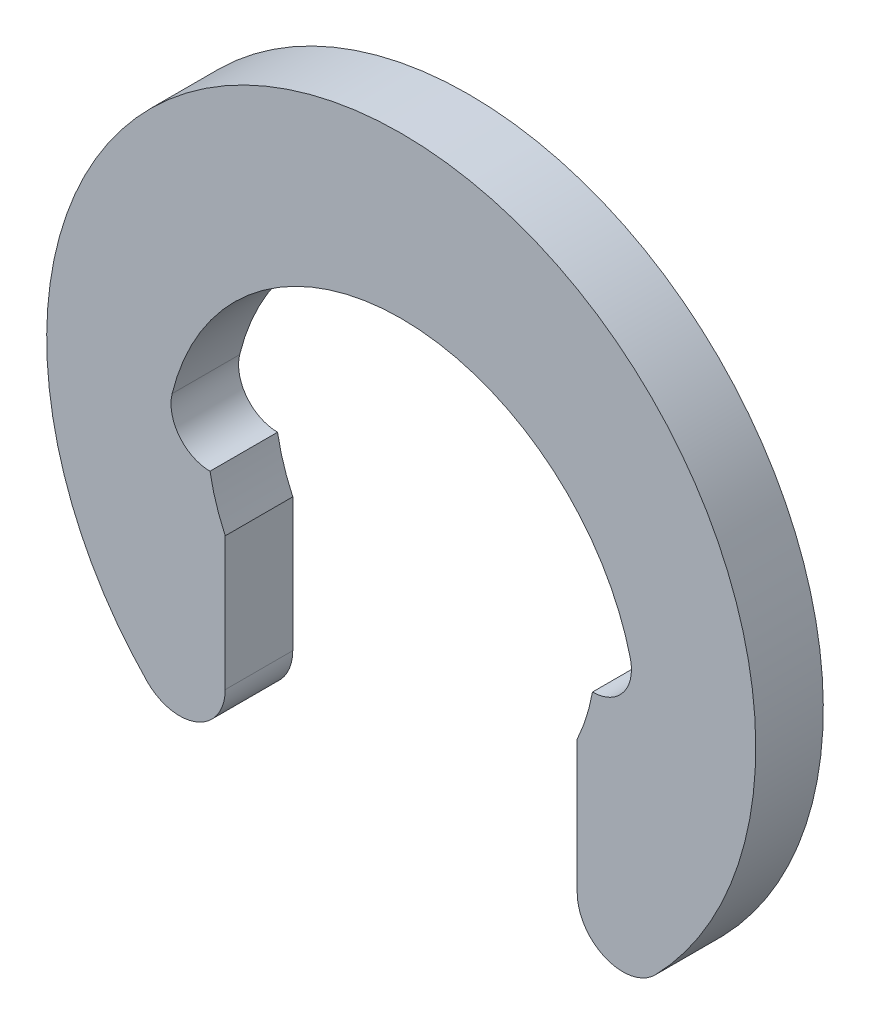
ISO-10303-21;
HEADER;
FILE_DESCRIPTION(('STEP AP214'),'2;1');
FILE_NAME('part.step','',(''),(''),'','','');
FILE_SCHEMA(('AUTOMOTIVE_DESIGN { 1 0 10303 214 1 1 1 1 }'));
ENDSEC;
DATA;
#1=APPLICATION_CONTEXT('core data for automotive mechanical design processes');
#2=APPLICATION_PROTOCOL_DEFINITION('international standard','automotive_design',2000,#1);
#3=PRODUCT_CONTEXT('',#1,'mechanical');
#4=PRODUCT('Part','Part','',(#3));
#5=PRODUCT_RELATED_PRODUCT_CATEGORY('part','',(#4));
#6=PRODUCT_DEFINITION_FORMATION('','',#4);
#7=PRODUCT_DEFINITION_CONTEXT('part definition',#1,'design');
#8=PRODUCT_DEFINITION('design','',#6,#7);
#9=PRODUCT_DEFINITION_SHAPE('','',#8);
#10=(LENGTH_UNIT() NAMED_UNIT(*) SI_UNIT(.MILLI.,.METRE.));
#11=(NAMED_UNIT(*) PLANE_ANGLE_UNIT() SI_UNIT($,.RADIAN.));
#12=(NAMED_UNIT(*) SI_UNIT($,.STERADIAN.) SOLID_ANGLE_UNIT());
#13=UNCERTAINTY_MEASURE_WITH_UNIT(LENGTH_MEASURE(1.E-05),#10,'distance_accuracy_value','');
#14=(GEOMETRIC_REPRESENTATION_CONTEXT(3) GLOBAL_UNCERTAINTY_ASSIGNED_CONTEXT((#13)) GLOBAL_UNIT_ASSIGNED_CONTEXT((#10,
#11,#12)) REPRESENTATION_CONTEXT('',''));
#15=CARTESIAN_POINT('',(0.,0.,0.));
#16=DIRECTION('',(0.,0.,1.));
#17=DIRECTION('',(1.,0.,0.));
#18=AXIS2_PLACEMENT_3D('',#15,#16,#17);
#19=CARTESIAN_POINT('',(0.,0.,-0.4));
#20=DIRECTION('',(0.,0.,1.));
#21=DIRECTION('',(1.,0.,0.));
#22=AXIS2_PLACEMENT_3D('',#19,#20,#21);
#23=CYLINDRICAL_SURFACE('',#22,1.15);
#24=CARTESIAN_POINT('',(0.,0.,0.));
#25=DIRECTION('',(0.,0.,-1.));
#26=DIRECTION('',(1.,0.,0.));
#27=AXIS2_PLACEMENT_3D('',#24,#25,#26);
#28=CIRCLE('',#27,1.15);
#29=CARTESIAN_POINT('',(-1.04225395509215,-0.486011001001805,0.));
#30=VERTEX_POINT('',#29);
#31=CARTESIAN_POINT('',(-1.13252891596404,-0.19969540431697,0.));
#32=VERTEX_POINT('',#31);
#33=EDGE_CURVE('E141',#30,#32,#28,.T.);
#34=ORIENTED_EDGE('',*,*,#33,.F.);
#35=DIRECTION('',(0.,0.,1.));
#36=VECTOR('',#35,1.);
#37=CARTESIAN_POINT('',(-1.04225395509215,-0.486011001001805,-0.4));
#38=LINE('',#37,#36);
#39=CARTESIAN_POINT('',(-1.04225395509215,-0.486011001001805,-0.4));
#40=VERTEX_POINT('',#39);
#41=EDGE_CURVE('E11',#40,#30,#38,.T.);
#42=ORIENTED_EDGE('',*,*,#41,.F.);
#43=CARTESIAN_POINT('',(0.,0.,-0.4));
#44=DIRECTION('',(0.,0.,-1.));
#45=DIRECTION('',(1.,0.,0.));
#46=AXIS2_PLACEMENT_3D('',#43,#44,#45);
#47=CIRCLE('',#46,1.15);
#48=CARTESIAN_POINT('',(-1.13252891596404,-0.19969540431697,-0.4));
#49=VERTEX_POINT('',#48);
#50=EDGE_CURVE('E167',#40,#49,#47,.T.);
#51=ORIENTED_EDGE('',*,*,#50,.T.);
#52=DIRECTION('',(0.,0.,1.));
#53=VECTOR('',#52,1.);
#54=CARTESIAN_POINT('',(-1.13252891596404,-0.19969540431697,-0.4));
#55=LINE('',#54,#53);
#56=EDGE_CURVE('E35',#49,#32,#55,.T.);
#57=ORIENTED_EDGE('',*,*,#56,.T.);
#58=EDGE_LOOP('',(#34,#42,#51,#57));
#59=FACE_BOUND('',#58,.T.);
#60=ADVANCED_FACE('F32',(#59),#23,.F.);
#61=CARTESIAN_POINT('',(-1.04225395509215,-0.486011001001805,-0.4));
#62=DIRECTION('',(1.,0.,0.));
#63=DIRECTION('',(0.,1.,0.));
#64=AXIS2_PLACEMENT_3D('',#61,#62,#63);
#65=PLANE('',#64);
#66=DIRECTION('',(0.,1.,0.));
#67=VECTOR('',#66,1.);
#68=CARTESIAN_POINT('',(-1.04225395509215,-0.486011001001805,0.));
#69=LINE('',#68,#67);
#70=CARTESIAN_POINT('',(-1.04225395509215,-1.27483758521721,0.));
#71=VERTEX_POINT('',#70);
#72=EDGE_CURVE('E165',#71,#30,#69,.T.);
#73=ORIENTED_EDGE('',*,*,#72,.F.);
#74=DIRECTION('',(0.,0.,1.));
#75=VECTOR('',#74,1.);
#76=CARTESIAN_POINT('',(-1.04225395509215,-1.27483758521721,-0.4));
#77=LINE('',#76,#75);
#78=CARTESIAN_POINT('',(-1.04225395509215,-1.27483758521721,-0.4));
#79=VERTEX_POINT('',#78);
#80=EDGE_CURVE('E41',#79,#71,#77,.T.);
#81=ORIENTED_EDGE('',*,*,#80,.F.);
#82=DIRECTION('',(0.,1.,0.));
#83=VECTOR('',#82,1.);
#84=CARTESIAN_POINT('',(-1.04225395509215,-0.486011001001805,-0.4));
#85=LINE('',#84,#83);
#86=EDGE_CURVE('E131',#79,#40,#85,.T.);
#87=ORIENTED_EDGE('',*,*,#86,.T.);
#88=ORIENTED_EDGE('',*,*,#41,.T.);
#89=EDGE_LOOP('',(#73,#81,#87,#88));
#90=FACE_BOUND('',#89,.T.);
#91=ADVANCED_FACE('F183',(#90),#65,.T.);
#92=CARTESIAN_POINT('',(-1.31225395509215,-1.27483758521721,-0.4));
#93=DIRECTION('',(0.,0.,1.));
#94=DIRECTION('',(1.,0.,0.));
#95=AXIS2_PLACEMENT_3D('',#92,#93,#94);
#96=CYLINDRICAL_SURFACE('',#95,0.27);
#97=CARTESIAN_POINT('',(-1.31225395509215,-1.27483758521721,0.));
#98=DIRECTION('',(0.,0.,1.));
#99=DIRECTION('',(1.,0.,0.));
#100=AXIS2_PLACEMENT_3D('',#97,#98,#99);
#101=CIRCLE('',#100,0.27);
#102=CARTESIAN_POINT('',(-1.50591373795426,-1.46297553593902,0.));
#103=VERTEX_POINT('',#102);
#104=EDGE_CURVE('E118',#103,#71,#101,.T.);
#105=ORIENTED_EDGE('',*,*,#104,.F.);
#106=DIRECTION('',(0.,0.,1.));
#107=VECTOR('',#106,1.);
#108=CARTESIAN_POINT('',(-1.50591373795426,-1.46297553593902,-0.4));
#109=LINE('',#108,#107);
#110=CARTESIAN_POINT('',(-1.50591373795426,-1.46297553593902,-0.4));
#111=VERTEX_POINT('',#110);
#112=EDGE_CURVE('E113',#111,#103,#109,.T.);
#113=ORIENTED_EDGE('',*,*,#112,.F.);
#114=CARTESIAN_POINT('',(-1.31225395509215,-1.27483758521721,-0.4));
#115=DIRECTION('',(0.,0.,1.));
#116=DIRECTION('',(1.,0.,0.));
#117=AXIS2_PLACEMENT_3D('',#114,#115,#116);
#118=CIRCLE('',#117,0.27);
#119=EDGE_CURVE('E116',#111,#79,#118,.T.);
#120=ORIENTED_EDGE('',*,*,#119,.T.);
#121=ORIENTED_EDGE('',*,*,#80,.T.);
#122=EDGE_LOOP('',(#105,#113,#120,#121));
#123=FACE_BOUND('',#122,.T.);
#124=ADVANCED_FACE('F115',(#123),#96,.T.);
#125=CARTESIAN_POINT('',(0.,0.,-0.4));
#126=DIRECTION('',(0.,0.,1.));
#127=DIRECTION('',(1.,0.,0.));
#128=AXIS2_PLACEMENT_3D('',#125,#126,#127);
#129=CYLINDRICAL_SURFACE('',#128,2.09954128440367);
#130=CARTESIAN_POINT('',(0.,0.,0.));
#131=DIRECTION('',(0.,0.,1.));
#132=DIRECTION('',(1.,0.,0.));
#133=AXIS2_PLACEMENT_3D('',#130,#131,#132);
#134=CIRCLE('',#133,2.09954128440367);
#135=CARTESIAN_POINT('',(1.50591373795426,-1.46297553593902,0.));
#136=VERTEX_POINT('',#135);
#137=EDGE_CURVE('E162',#136,#103,#134,.T.);
#138=ORIENTED_EDGE('',*,*,#137,.F.);
#139=DIRECTION('',(0.,0.,1.));
#140=VECTOR('',#139,1.);
#141=CARTESIAN_POINT('',(1.50591373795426,-1.46297553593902,-0.4));
#142=LINE('',#141,#140);
#143=CARTESIAN_POINT('',(1.50591373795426,-1.46297553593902,-0.4));
#144=VERTEX_POINT('',#143);
#145=EDGE_CURVE('E123',#144,#136,#142,.T.);
#146=ORIENTED_EDGE('',*,*,#145,.F.);
#147=CARTESIAN_POINT('',(0.,0.,-0.4));
#148=DIRECTION('',(0.,0.,1.));
#149=DIRECTION('',(1.,0.,0.));
#150=AXIS2_PLACEMENT_3D('',#147,#148,#149);
#151=CIRCLE('',#150,2.09954128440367);
#152=EDGE_CURVE('E129',#144,#111,#151,.T.);
#153=ORIENTED_EDGE('',*,*,#152,.T.);
#154=ORIENTED_EDGE('',*,*,#112,.T.);
#155=EDGE_LOOP('',(#138,#146,#153,#154));
#156=FACE_BOUND('',#155,.T.);
#157=ADVANCED_FACE('F133',(#156),#129,.T.);
#158=CARTESIAN_POINT('',(1.31225395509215,-1.27483758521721,-0.4));
#159=DIRECTION('',(0.,0.,1.));
#160=DIRECTION('',(1.,0.,0.));
#161=AXIS2_PLACEMENT_3D('',#158,#159,#160);
#162=CYLINDRICAL_SURFACE('',#161,0.27);
#163=CARTESIAN_POINT('',(1.31225395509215,-1.27483758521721,0.));
#164=DIRECTION('',(0.,0.,1.));
#165=DIRECTION('',(1.,0.,0.));
#166=AXIS2_PLACEMENT_3D('',#163,#164,#165);
#167=CIRCLE('',#166,0.27);
#168=CARTESIAN_POINT('',(1.04225395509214,-1.27483758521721,0.));
#169=VERTEX_POINT('',#168);
#170=EDGE_CURVE('E159',#169,#136,#167,.T.);
#171=ORIENTED_EDGE('',*,*,#170,.F.);
#172=DIRECTION('',(0.,0.,1.));
#173=VECTOR('',#172,1.);
#174=CARTESIAN_POINT('',(1.04225395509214,-1.27483758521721,-0.4));
#175=LINE('',#174,#173);
#176=CARTESIAN_POINT('',(1.04225395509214,-1.27483758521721,-0.4));
#177=VERTEX_POINT('',#176);
#178=EDGE_CURVE('E171',#177,#169,#175,.T.);
#179=ORIENTED_EDGE('',*,*,#178,.F.);
#180=CARTESIAN_POINT('',(1.31225395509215,-1.27483758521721,-0.4));
#181=DIRECTION('',(0.,0.,1.));
#182=DIRECTION('',(1.,0.,0.));
#183=AXIS2_PLACEMENT_3D('',#180,#181,#182);
#184=CIRCLE('',#183,0.27);
#185=EDGE_CURVE('E134',#177,#144,#184,.T.);
#186=ORIENTED_EDGE('',*,*,#185,.T.);
#187=ORIENTED_EDGE('',*,*,#145,.T.);
#188=EDGE_LOOP('',(#171,#179,#186,#187));
#189=FACE_BOUND('',#188,.T.);
#190=ADVANCED_FACE('F196',(#189),#162,.T.);
#191=CARTESIAN_POINT('',(1.04225395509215,-0.486011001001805,-0.4));
#192=DIRECTION('',(-1.,0.,0.));
#193=DIRECTION('',(0.,-1.,0.));
#194=AXIS2_PLACEMENT_3D('',#191,#192,#193);
#195=PLANE('',#194);
#196=DIRECTION('',(0.,-1.,0.));
#197=VECTOR('',#196,1.);
#198=CARTESIAN_POINT('',(1.04225395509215,-0.486011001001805,0.));
#199=LINE('',#198,#197);
#200=CARTESIAN_POINT('',(1.04225395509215,-0.486011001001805,0.));
#201=VERTEX_POINT('',#200);
#202=EDGE_CURVE('E156',#201,#169,#199,.T.);
#203=ORIENTED_EDGE('',*,*,#202,.F.);
#204=DIRECTION('',(0.,0.,1.));
#205=VECTOR('',#204,1.);
#206=CARTESIAN_POINT('',(1.04225395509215,-0.486011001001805,-0.4));
#207=LINE('',#206,#205);
#208=CARTESIAN_POINT('',(1.04225395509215,-0.486011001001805,-0.4));
#209=VERTEX_POINT('',#208);
#210=EDGE_CURVE('E173',#209,#201,#207,.T.);
#211=ORIENTED_EDGE('',*,*,#210,.F.);
#212=DIRECTION('',(0.,-1.,0.));
#213=VECTOR('',#212,1.);
#214=CARTESIAN_POINT('',(1.04225395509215,-0.486011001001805,-0.4));
#215=LINE('',#214,#213);
#216=EDGE_CURVE('E136',#209,#177,#215,.T.);
#217=ORIENTED_EDGE('',*,*,#216,.T.);
#218=ORIENTED_EDGE('',*,*,#178,.T.);
#219=EDGE_LOOP('',(#203,#211,#217,#218));
#220=FACE_BOUND('',#219,.T.);
#221=ADVANCED_FACE('F199',(#220),#195,.T.);
#222=CARTESIAN_POINT('',(0.,0.,-0.4));
#223=DIRECTION('',(0.,0.,1.));
#224=DIRECTION('',(1.,0.,0.));
#225=AXIS2_PLACEMENT_3D('',#222,#223,#224);
#226=CYLINDRICAL_SURFACE('',#225,1.15);
#227=CARTESIAN_POINT('',(0.,0.,0.));
#228=DIRECTION('',(0.,0.,-1.));
#229=DIRECTION('',(1.,0.,0.));
#230=AXIS2_PLACEMENT_3D('',#227,#228,#229);
#231=CIRCLE('',#230,1.15);
#232=CARTESIAN_POINT('',(1.13252891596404,-0.199695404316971,0.));
#233=VERTEX_POINT('',#232);
#234=EDGE_CURVE('E153',#233,#201,#231,.T.);
#235=ORIENTED_EDGE('',*,*,#234,.F.);
#236=DIRECTION('',(0.,0.,1.));
#237=VECTOR('',#236,1.);
#238=CARTESIAN_POINT('',(1.13252891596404,-0.199695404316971,-0.4));
#239=LINE('',#238,#237);
#240=CARTESIAN_POINT('',(1.13252891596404,-0.199695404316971,-0.4));
#241=VERTEX_POINT('',#240);
#242=EDGE_CURVE('E175',#241,#233,#239,.T.);
#243=ORIENTED_EDGE('',*,*,#242,.F.);
#244=CARTESIAN_POINT('',(0.,0.,-0.4));
#245=DIRECTION('',(0.,0.,-1.));
#246=DIRECTION('',(1.,0.,0.));
#247=AXIS2_PLACEMENT_3D('',#244,#245,#246);
#248=CIRCLE('',#247,1.15);
#249=EDGE_CURVE('E298',#241,#209,#248,.T.);
#250=ORIENTED_EDGE('',*,*,#249,.T.);
#251=ORIENTED_EDGE('',*,*,#210,.T.);
#252=EDGE_LOOP('',(#235,#243,#250,#251));
#253=FACE_BOUND('',#252,.T.);
#254=ADVANCED_FACE('F203',(#253),#226,.F.);
#255=CARTESIAN_POINT('',(1.13252891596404,0.0311315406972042,-0.4));
#256=DIRECTION('',(0.,0.,1.));
#257=DIRECTION('',(1.,0.,0.));
#258=AXIS2_PLACEMENT_3D('',#255,#256,#257);
#259=CYLINDRICAL_SURFACE('',#258,0.230826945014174);
#260=CARTESIAN_POINT('',(1.13252891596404,0.0311315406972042,0.));
#261=DIRECTION('',(0.,0.,-1.));
#262=DIRECTION('',(1.,0.,0.));
#263=AXIS2_PLACEMENT_3D('',#260,#261,#262);
#264=CIRCLE('',#263,0.230826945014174);
#265=CARTESIAN_POINT('',(1.35669440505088,0.0861852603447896,0.));
#266=VERTEX_POINT('',#265);
#267=EDGE_CURVE('E150',#266,#233,#264,.T.);
#268=ORIENTED_EDGE('',*,*,#267,.F.);
#269=DIRECTION('',(0.,0.,1.));
#270=VECTOR('',#269,1.);
#271=CARTESIAN_POINT('',(1.35669440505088,0.0861852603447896,-0.4));
#272=LINE('',#271,#270);
#273=CARTESIAN_POINT('',(1.35669440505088,0.0861852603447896,-0.4));
#274=VERTEX_POINT('',#273);
#275=EDGE_CURVE('E177',#274,#266,#272,.T.);
#276=ORIENTED_EDGE('',*,*,#275,.F.);
#277=CARTESIAN_POINT('',(1.13252891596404,0.0311315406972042,-0.4));
#278=DIRECTION('',(0.,0.,-1.));
#279=DIRECTION('',(1.,0.,0.));
#280=AXIS2_PLACEMENT_3D('',#277,#278,#279);
#281=CIRCLE('',#280,0.230826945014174);
#282=EDGE_CURVE('E294',#274,#241,#281,.T.);
#283=ORIENTED_EDGE('',*,*,#282,.T.);
#284=ORIENTED_EDGE('',*,*,#242,.T.);
#285=EDGE_LOOP('',(#268,#276,#283,#284));
#286=FACE_BOUND('',#285,.T.);
#287=ADVANCED_FACE('F207',(#286),#259,.F.);
#288=CARTESIAN_POINT('',(0.,-0.247010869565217,-0.4));
#289=DIRECTION('',(0.,0.,1.));
#290=DIRECTION('',(1.,0.,0.));
#291=AXIS2_PLACEMENT_3D('',#288,#289,#290);
#292=CYLINDRICAL_SURFACE('',#291,1.39701086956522);
#293=CARTESIAN_POINT('',(0.,-0.247010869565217,0.));
#294=DIRECTION('',(0.,0.,-1.));
#295=DIRECTION('',(1.,0.,0.));
#296=AXIS2_PLACEMENT_3D('',#293,#294,#295);
#297=CIRCLE('',#296,1.39701086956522);
#298=CARTESIAN_POINT('',(-1.35669440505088,0.0861852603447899,0.));
#299=VERTEX_POINT('',#298);
#300=EDGE_CURVE('E147',#299,#266,#297,.T.);
#301=ORIENTED_EDGE('',*,*,#300,.F.);
#302=DIRECTION('',(0.,0.,1.));
#303=VECTOR('',#302,1.);
#304=CARTESIAN_POINT('',(-1.35669440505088,0.0861852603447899,-0.4));
#305=LINE('',#304,#303);
#306=CARTESIAN_POINT('',(-1.35669440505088,0.0861852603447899,-0.4));
#307=VERTEX_POINT('',#306);
#308=EDGE_CURVE('E178',#307,#299,#305,.T.);
#309=ORIENTED_EDGE('',*,*,#308,.F.);
#310=CARTESIAN_POINT('',(0.,-0.247010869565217,-0.4));
#311=DIRECTION('',(0.,0.,-1.));
#312=DIRECTION('',(1.,0.,0.));
#313=AXIS2_PLACEMENT_3D('',#310,#311,#312);
#314=CIRCLE('',#313,1.39701086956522);
#315=EDGE_CURVE('E305',#307,#274,#314,.T.);
#316=ORIENTED_EDGE('',*,*,#315,.T.);
#317=ORIENTED_EDGE('',*,*,#275,.T.);
#318=EDGE_LOOP('',(#301,#309,#316,#317));
#319=FACE_BOUND('',#318,.T.);
#320=ADVANCED_FACE('F211',(#319),#292,.F.);
#321=CARTESIAN_POINT('',(-1.13252891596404,0.0311315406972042,-0.4));
#322=DIRECTION('',(0.,0.,1.));
#323=DIRECTION('',(1.,0.,0.));
#324=AXIS2_PLACEMENT_3D('',#321,#322,#323);
#325=CYLINDRICAL_SURFACE('',#324,0.230826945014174);
#326=CARTESIAN_POINT('',(-1.13252891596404,0.0311315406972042,0.));
#327=DIRECTION('',(0.,0.,-1.));
#328=DIRECTION('',(1.,0.,0.));
#329=AXIS2_PLACEMENT_3D('',#326,#327,#328);
#330=CIRCLE('',#329,0.230826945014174);
#331=EDGE_CURVE('E144',#32,#299,#330,.T.);
#332=ORIENTED_EDGE('',*,*,#331,.F.);
#333=ORIENTED_EDGE('',*,*,#56,.F.);
#334=CARTESIAN_POINT('',(-1.13252891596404,0.0311315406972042,-0.4));
#335=DIRECTION('',(0.,0.,-1.));
#336=DIRECTION('',(1.,0.,0.));
#337=AXIS2_PLACEMENT_3D('',#334,#335,#336);
#338=CIRCLE('',#337,0.230826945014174);
#339=EDGE_CURVE('E307',#49,#307,#338,.T.);
#340=ORIENTED_EDGE('',*,*,#339,.T.);
#341=ORIENTED_EDGE('',*,*,#308,.T.);
#342=EDGE_LOOP('',(#332,#333,#340,#341));
#343=FACE_BOUND('',#342,.T.);
#344=ADVANCED_FACE('F180',(#343),#325,.F.);
#345=CARTESIAN_POINT('',(0.,0.,-0.4));
#346=DIRECTION('',(0.,0.,1.));
#347=DIRECTION('',(1.,0.,0.));
#348=AXIS2_PLACEMENT_3D('',#345,#346,#347);
#349=PLANE('',#348);
#350=ORIENTED_EDGE('',*,*,#50,.F.);
#351=ORIENTED_EDGE('',*,*,#86,.F.);
#352=ORIENTED_EDGE('',*,*,#119,.F.);
#353=ORIENTED_EDGE('',*,*,#152,.F.);
#354=ORIENTED_EDGE('',*,*,#185,.F.);
#355=ORIENTED_EDGE('',*,*,#216,.F.);
#356=ORIENTED_EDGE('',*,*,#249,.F.);
#357=ORIENTED_EDGE('',*,*,#282,.F.);
#358=ORIENTED_EDGE('',*,*,#315,.F.);
#359=ORIENTED_EDGE('',*,*,#339,.F.);
#360=EDGE_LOOP('',(#350,#351,#352,#353,#354,#355,#356,#357,#358,#359));
#361=FACE_BOUND('',#360,.T.);
#362=ADVANCED_FACE('F127',(#361),#349,.F.);
#363=CARTESIAN_POINT('',(0.,0.,0.));
#364=DIRECTION('',(0.,0.,1.));
#365=DIRECTION('',(1.,0.,0.));
#366=AXIS2_PLACEMENT_3D('',#363,#364,#365);
#367=PLANE('',#366);
#368=ORIENTED_EDGE('',*,*,#33,.T.);
#369=ORIENTED_EDGE('',*,*,#331,.T.);
#370=ORIENTED_EDGE('',*,*,#300,.T.);
#371=ORIENTED_EDGE('',*,*,#267,.T.);
#372=ORIENTED_EDGE('',*,*,#234,.T.);
#373=ORIENTED_EDGE('',*,*,#202,.T.);
#374=ORIENTED_EDGE('',*,*,#170,.T.);
#375=ORIENTED_EDGE('',*,*,#137,.T.);
#376=ORIENTED_EDGE('',*,*,#104,.T.);
#377=ORIENTED_EDGE('',*,*,#72,.T.);
#378=EDGE_LOOP('',(#368,#369,#370,#371,#372,#373,#374,#375,#376,#377));
#379=FACE_BOUND('',#378,.T.);
#380=ADVANCED_FACE('F182',(#379),#367,.T.);
#381=CLOSED_SHELL('',(#60,#91,#124,#157,#190,#221,#254,#287,#320,#344,#362,#380));
#382=MANIFOLD_SOLID_BREP('B2',#381);
#383=ADVANCED_BREP_SHAPE_REPRESENTATION('',(#18,#382),#14);
#384=SHAPE_DEFINITION_REPRESENTATION(#9,#383);
ENDSEC;
END-ISO-10303-21;
